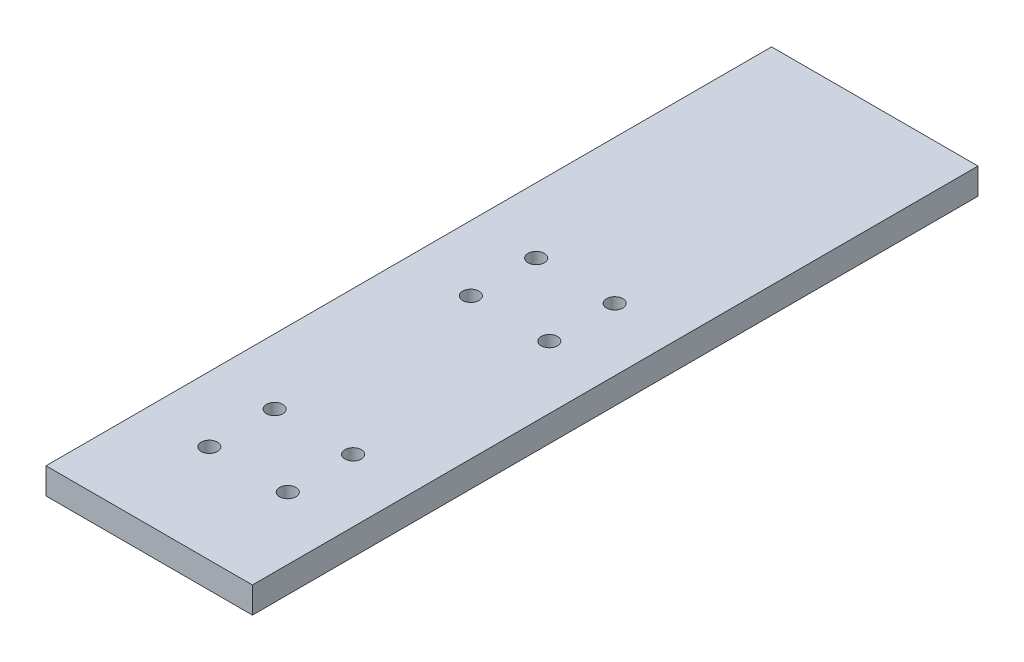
ISO-10303-21;
HEADER;
FILE_DESCRIPTION(('STEP AP214'),'2;1');
FILE_NAME('part.step','',(''),(''),'','','');
FILE_SCHEMA(('AUTOMOTIVE_DESIGN { 1 0 10303 214 1 1 1 1 }'));
ENDSEC;
DATA;
#1=APPLICATION_CONTEXT('core data for automotive mechanical design processes');
#2=APPLICATION_PROTOCOL_DEFINITION('international standard','automotive_design',2000,#1);
#3=PRODUCT_CONTEXT('',#1,'mechanical');
#4=PRODUCT('Part','Part','',(#3));
#5=PRODUCT_RELATED_PRODUCT_CATEGORY('part','',(#4));
#6=PRODUCT_DEFINITION_FORMATION('','',#4);
#7=PRODUCT_DEFINITION_CONTEXT('part definition',#1,'design');
#8=PRODUCT_DEFINITION('design','',#6,#7);
#9=PRODUCT_DEFINITION_SHAPE('','',#8);
#10=(LENGTH_UNIT() NAMED_UNIT(*) SI_UNIT(.MILLI.,.METRE.));
#11=(NAMED_UNIT(*) PLANE_ANGLE_UNIT() SI_UNIT($,.RADIAN.));
#12=(NAMED_UNIT(*) SI_UNIT($,.STERADIAN.) SOLID_ANGLE_UNIT());
#13=UNCERTAINTY_MEASURE_WITH_UNIT(LENGTH_MEASURE(1.E-05),#10,'distance_accuracy_value','');
#14=(GEOMETRIC_REPRESENTATION_CONTEXT(3) GLOBAL_UNCERTAINTY_ASSIGNED_CONTEXT((#13)) GLOBAL_UNIT_ASSIGNED_CONTEXT((#10,
#11,#12)) REPRESENTATION_CONTEXT('',''));
#15=CARTESIAN_POINT('',(0.,0.,0.));
#16=DIRECTION('',(0.,0.,1.));
#17=DIRECTION('',(1.,0.,0.));
#18=AXIS2_PLACEMENT_3D('',#15,#16,#17);
#19=CARTESIAN_POINT('',(198.0556,50.8,901.37465906));
#20=DIRECTION('',(-1.,0.,0.));
#21=DIRECTION('',(0.,0.,1.));
#22=AXIS2_PLACEMENT_3D('',#19,#20,#21);
#23=PLANE('',#22);
#24=DIRECTION('',(0.,0.,-1.));
#25=VECTOR('',#24,1.);
#26=CARTESIAN_POINT('',(198.0556,0.,901.37465906));
#27=LINE('',#26,#25);
#28=CARTESIAN_POINT('',(198.0556,0.,901.37465906));
#29=VERTEX_POINT('',#28);
#30=CARTESIAN_POINT('',(198.0556,0.,-508.00000001));
#31=VERTEX_POINT('',#30);
#32=EDGE_CURVE('E114',#29,#31,#27,.T.);
#33=ORIENTED_EDGE('',*,*,#32,.T.);
#34=DIRECTION('',(0.,-1.,0.));
#35=VECTOR('',#34,1.);
#36=CARTESIAN_POINT('',(198.0556,50.8,-508.00000001));
#37=LINE('',#36,#35);
#38=CARTESIAN_POINT('',(198.0556,50.8,-508.00000001));
#39=VERTEX_POINT('',#38);
#40=EDGE_CURVE('E11',#39,#31,#37,.T.);
#41=ORIENTED_EDGE('',*,*,#40,.F.);
#42=DIRECTION('',(0.,0.,-1.));
#43=VECTOR('',#42,1.);
#44=CARTESIAN_POINT('',(198.0556,50.8,901.37465906));
#45=LINE('',#44,#43);
#46=CARTESIAN_POINT('',(198.0556,50.8,901.37465906));
#47=VERTEX_POINT('',#46);
#48=EDGE_CURVE('E100',#47,#39,#45,.T.);
#49=ORIENTED_EDGE('',*,*,#48,.F.);
#50=DIRECTION('',(0.,-1.,0.));
#51=VECTOR('',#50,1.);
#52=CARTESIAN_POINT('',(198.0556,50.8,901.37465906));
#53=LINE('',#52,#51);
#54=EDGE_CURVE('E108',#47,#29,#53,.T.);
#55=ORIENTED_EDGE('',*,*,#54,.T.);
#56=EDGE_LOOP('',(#33,#41,#49,#55));
#57=FACE_BOUND('',#56,.T.);
#58=ADVANCED_FACE('F44',(#57),#23,.F.);
#59=CARTESIAN_POINT('',(198.0556,50.8,-508.00000001));
#60=DIRECTION('',(0.,0.,1.));
#61=DIRECTION('',(1.,0.,0.));
#62=AXIS2_PLACEMENT_3D('',#59,#60,#61);
#63=PLANE('',#62);
#64=DIRECTION('',(-1.,0.,0.));
#65=VECTOR('',#64,1.);
#66=CARTESIAN_POINT('',(198.0556,0.,-508.00000001));
#67=LINE('',#66,#65);
#68=CARTESIAN_POINT('',(-202.9084,0.,-508.00000001));
#69=VERTEX_POINT('',#68);
#70=EDGE_CURVE('E105',#31,#69,#67,.T.);
#71=ORIENTED_EDGE('',*,*,#70,.T.);
#72=DIRECTION('',(0.,-1.,0.));
#73=VECTOR('',#72,1.);
#74=CARTESIAN_POINT('',(-202.9084,50.8,-508.00000001));
#75=LINE('',#74,#73);
#76=CARTESIAN_POINT('',(-202.9084,50.8,-508.00000001));
#77=VERTEX_POINT('',#76);
#78=EDGE_CURVE('E53',#77,#69,#75,.T.);
#79=ORIENTED_EDGE('',*,*,#78,.F.);
#80=DIRECTION('',(-1.,0.,0.));
#81=VECTOR('',#80,1.);
#82=CARTESIAN_POINT('',(198.0556,50.8,-508.00000001));
#83=LINE('',#82,#81);
#84=EDGE_CURVE('E95',#39,#77,#83,.T.);
#85=ORIENTED_EDGE('',*,*,#84,.F.);
#86=ORIENTED_EDGE('',*,*,#40,.T.);
#87=EDGE_LOOP('',(#71,#79,#85,#86));
#88=FACE_BOUND('',#87,.T.);
#89=ADVANCED_FACE('F101',(#88),#63,.F.);
#90=CARTESIAN_POINT('',(-202.9084,50.8,901.37465906));
#91=DIRECTION('',(1.,0.,0.));
#92=DIRECTION('',(0.,0.,-1.));
#93=AXIS2_PLACEMENT_3D('',#90,#91,#92);
#94=PLANE('',#93);
#95=DIRECTION('',(0.,0.,1.));
#96=VECTOR('',#95,1.);
#97=CARTESIAN_POINT('',(-202.9084,0.,901.37465906));
#98=LINE('',#97,#96);
#99=CARTESIAN_POINT('',(-202.9084,0.,901.37465906));
#100=VERTEX_POINT('',#99);
#101=EDGE_CURVE('E76',#69,#100,#98,.T.);
#102=ORIENTED_EDGE('',*,*,#101,.T.);
#103=DIRECTION('',(0.,-1.,0.));
#104=VECTOR('',#103,1.);
#105=CARTESIAN_POINT('',(-202.9084,50.8,901.37465906));
#106=LINE('',#105,#104);
#107=CARTESIAN_POINT('',(-202.9084,50.8,901.37465906));
#108=VERTEX_POINT('',#107);
#109=EDGE_CURVE('E102',#108,#100,#106,.T.);
#110=ORIENTED_EDGE('',*,*,#109,.F.);
#111=DIRECTION('',(0.,0.,1.));
#112=VECTOR('',#111,1.);
#113=CARTESIAN_POINT('',(-202.9084,50.8,901.37465906));
#114=LINE('',#113,#112);
#115=EDGE_CURVE('E92',#77,#108,#114,.T.);
#116=ORIENTED_EDGE('',*,*,#115,.F.);
#117=ORIENTED_EDGE('',*,*,#78,.T.);
#118=EDGE_LOOP('',(#102,#110,#116,#117));
#119=FACE_BOUND('',#118,.T.);
#120=ADVANCED_FACE('F104',(#119),#94,.F.);
#121=CARTESIAN_POINT('',(198.0556,50.8,901.37465906));
#122=DIRECTION('',(0.,0.,-1.));
#123=DIRECTION('',(-1.,0.,0.));
#124=AXIS2_PLACEMENT_3D('',#121,#122,#123);
#125=PLANE('',#124);
#126=DIRECTION('',(1.,0.,0.));
#127=VECTOR('',#126,1.);
#128=CARTESIAN_POINT('',(198.0556,0.,901.37465906));
#129=LINE('',#128,#127);
#130=EDGE_CURVE('E81',#100,#29,#129,.T.);
#131=ORIENTED_EDGE('',*,*,#130,.T.);
#132=ORIENTED_EDGE('',*,*,#54,.F.);
#133=DIRECTION('',(1.,0.,0.));
#134=VECTOR('',#133,1.);
#135=CARTESIAN_POINT('',(198.0556,50.8,901.37465906));
#136=LINE('',#135,#134);
#137=EDGE_CURVE('E64',#108,#47,#136,.T.);
#138=ORIENTED_EDGE('',*,*,#137,.F.);
#139=ORIENTED_EDGE('',*,*,#109,.T.);
#140=EDGE_LOOP('',(#131,#132,#138,#139));
#141=FACE_BOUND('',#140,.T.);
#142=ADVANCED_FACE('F130',(#141),#125,.F.);
#143=CARTESIAN_POINT('',(0.,50.8,0.));
#144=DIRECTION('',(0.,1.,0.));
#145=DIRECTION('',(0.,0.,1.));
#146=AXIS2_PLACEMENT_3D('',#143,#144,#145);
#147=PLANE('',#146);
#148=CARTESIAN_POINT('',(-76.1999999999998,50.8,710.87465906));
#149=DIRECTION('',(0.,1.,0.));
#150=DIRECTION('',(0.,0.,1.));
#151=AXIS2_PLACEMENT_3D('',#148,#149,#150);
#152=CIRCLE('',#151,15.8749999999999);
#153=CARTESIAN_POINT('',(-76.1999999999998,50.8,726.74965906));
#154=VERTEX_POINT('',#153);
#155=EDGE_CURVE('E170',#154,#154,#152,.T.);
#156=ORIENTED_EDGE('',*,*,#155,.F.);
#157=EDGE_LOOP('',(#156));
#158=FACE_BOUND('',#157,.T.);
#159=CARTESIAN_POINT('',(-76.1999999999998,50.8,75.87465906));
#160=DIRECTION('',(0.,1.,0.));
#161=DIRECTION('',(0.,0.,1.));
#162=AXIS2_PLACEMENT_3D('',#159,#160,#161);
#163=CIRCLE('',#162,15.875);
#164=CARTESIAN_POINT('',(-76.1999999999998,50.8,91.7496590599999));
#165=VERTEX_POINT('',#164);
#166=EDGE_CURVE('E157',#165,#165,#163,.T.);
#167=ORIENTED_EDGE('',*,*,#166,.F.);
#168=EDGE_LOOP('',(#167));
#169=FACE_BOUND('',#168,.T.);
#170=CARTESIAN_POINT('',(76.2000000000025,50.8,75.87465906));
#171=DIRECTION('',(0.,1.,0.));
#172=DIRECTION('',(0.,0.,1.));
#173=AXIS2_PLACEMENT_3D('',#170,#171,#172);
#174=CIRCLE('',#173,15.875);
#175=CARTESIAN_POINT('',(76.2000000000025,50.8,91.7496590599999));
#176=VERTEX_POINT('',#175);
#177=EDGE_CURVE('E151',#176,#176,#174,.T.);
#178=ORIENTED_EDGE('',*,*,#177,.F.);
#179=EDGE_LOOP('',(#178));
#180=FACE_BOUND('',#179,.T.);
#181=CARTESIAN_POINT('',(76.2000000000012,50.8,583.87465906));
#182=DIRECTION('',(0.,1.,0.));
#183=DIRECTION('',(0.,0.,1.));
#184=AXIS2_PLACEMENT_3D('',#181,#182,#183);
#185=CIRCLE('',#184,15.875);
#186=CARTESIAN_POINT('',(76.2000000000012,50.8,599.74965906));
#187=VERTEX_POINT('',#186);
#188=EDGE_CURVE('E142',#187,#187,#185,.T.);
#189=ORIENTED_EDGE('',*,*,#188,.F.);
#190=EDGE_LOOP('',(#189));
#191=FACE_BOUND('',#190,.T.);
#192=CARTESIAN_POINT('',(-76.2000000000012,50.8,583.87465906));
#193=DIRECTION('',(0.,1.,0.));
#194=DIRECTION('',(0.,0.,1.));
#195=AXIS2_PLACEMENT_3D('',#192,#193,#194);
#196=CIRCLE('',#195,15.8749999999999);
#197=CARTESIAN_POINT('',(-76.2000000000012,50.8,599.74965906));
#198=VERTEX_POINT('',#197);
#199=EDGE_CURVE('E188',#198,#198,#196,.T.);
#200=ORIENTED_EDGE('',*,*,#199,.F.);
#201=EDGE_LOOP('',(#200));
#202=FACE_BOUND('',#201,.T.);
#203=CARTESIAN_POINT('',(-76.1999999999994,50.8,202.87465906));
#204=DIRECTION('',(0.,1.,0.));
#205=DIRECTION('',(0.,0.,1.));
#206=AXIS2_PLACEMENT_3D('',#203,#204,#205);
#207=CIRCLE('',#206,15.875);
#208=CARTESIAN_POINT('',(-76.1999999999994,50.8,218.74965906));
#209=VERTEX_POINT('',#208);
#210=EDGE_CURVE('E185',#209,#209,#207,.T.);
#211=ORIENTED_EDGE('',*,*,#210,.F.);
#212=EDGE_LOOP('',(#211));
#213=FACE_BOUND('',#212,.T.);
#214=CARTESIAN_POINT('',(76.2000000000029,50.8,202.87465906));
#215=DIRECTION('',(0.,1.,0.));
#216=DIRECTION('',(0.,0.,1.));
#217=AXIS2_PLACEMENT_3D('',#214,#215,#216);
#218=CIRCLE('',#217,15.8750000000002);
#219=CARTESIAN_POINT('',(76.2000000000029,50.8,218.74965906));
#220=VERTEX_POINT('',#219);
#221=EDGE_CURVE('E171',#220,#220,#218,.T.);
#222=ORIENTED_EDGE('',*,*,#221,.F.);
#223=EDGE_LOOP('',(#222));
#224=FACE_BOUND('',#223,.T.);
#225=CARTESIAN_POINT('',(76.2000000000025,50.8,710.87465906));
#226=DIRECTION('',(0.,1.,0.));
#227=DIRECTION('',(0.,0.,1.));
#228=AXIS2_PLACEMENT_3D('',#225,#226,#227);
#229=CIRCLE('',#228,15.8749999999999);
#230=CARTESIAN_POINT('',(76.2000000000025,50.8,726.74965906));
#231=VERTEX_POINT('',#230);
#232=EDGE_CURVE('E119',#231,#231,#229,.T.);
#233=ORIENTED_EDGE('',*,*,#232,.F.);
#234=EDGE_LOOP('',(#233));
#235=FACE_BOUND('',#234,.T.);
#236=ORIENTED_EDGE('',*,*,#48,.T.);
#237=ORIENTED_EDGE('',*,*,#84,.T.);
#238=ORIENTED_EDGE('',*,*,#115,.T.);
#239=ORIENTED_EDGE('',*,*,#137,.T.);
#240=EDGE_LOOP('',(#236,#237,#238,#239));
#241=FACE_BOUND('',#240,.T.);
#242=ADVANCED_FACE('F91',(#158,#169,#180,#191,#202,#213,#224,#235,#241),#147,.T.);
#243=CARTESIAN_POINT('',(0.,0.,0.));
#244=DIRECTION('',(0.,1.,0.));
#245=DIRECTION('',(0.,0.,1.));
#246=AXIS2_PLACEMENT_3D('',#243,#244,#245);
#247=PLANE('',#246);
#248=CARTESIAN_POINT('',(-76.1999999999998,0.,710.87465906));
#249=DIRECTION('',(0.,1.,0.));
#250=DIRECTION('',(0.,0.,1.));
#251=AXIS2_PLACEMENT_3D('',#248,#249,#250);
#252=CIRCLE('',#251,15.8749999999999);
#253=CARTESIAN_POINT('',(-76.1999999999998,0.,726.74965906));
#254=VERTEX_POINT('',#253);
#255=EDGE_CURVE('E137',#254,#254,#252,.T.);
#256=ORIENTED_EDGE('',*,*,#255,.T.);
#257=EDGE_LOOP('',(#256));
#258=FACE_BOUND('',#257,.T.);
#259=CARTESIAN_POINT('',(-76.1999999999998,0.,75.87465906));
#260=DIRECTION('',(0.,1.,0.));
#261=DIRECTION('',(0.,0.,1.));
#262=AXIS2_PLACEMENT_3D('',#259,#260,#261);
#263=CIRCLE('',#262,15.875);
#264=CARTESIAN_POINT('',(-76.1999999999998,0.,91.7496590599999));
#265=VERTEX_POINT('',#264);
#266=EDGE_CURVE('E162',#265,#265,#263,.T.);
#267=ORIENTED_EDGE('',*,*,#266,.T.);
#268=EDGE_LOOP('',(#267));
#269=FACE_BOUND('',#268,.T.);
#270=CARTESIAN_POINT('',(76.2000000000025,0.,75.87465906));
#271=DIRECTION('',(0.,1.,0.));
#272=DIRECTION('',(0.,0.,1.));
#273=AXIS2_PLACEMENT_3D('',#270,#271,#272);
#274=CIRCLE('',#273,15.875);
#275=CARTESIAN_POINT('',(76.2000000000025,0.,91.7496590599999));
#276=VERTEX_POINT('',#275);
#277=EDGE_CURVE('E154',#276,#276,#274,.T.);
#278=ORIENTED_EDGE('',*,*,#277,.T.);
#279=EDGE_LOOP('',(#278));
#280=FACE_BOUND('',#279,.T.);
#281=CARTESIAN_POINT('',(76.2000000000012,0.,583.87465906));
#282=DIRECTION('',(0.,1.,0.));
#283=DIRECTION('',(0.,0.,1.));
#284=AXIS2_PLACEMENT_3D('',#281,#282,#283);
#285=CIRCLE('',#284,15.875);
#286=CARTESIAN_POINT('',(76.2000000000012,0.,599.74965906));
#287=VERTEX_POINT('',#286);
#288=EDGE_CURVE('E148',#287,#287,#285,.T.);
#289=ORIENTED_EDGE('',*,*,#288,.T.);
#290=EDGE_LOOP('',(#289));
#291=FACE_BOUND('',#290,.T.);
#292=CARTESIAN_POINT('',(-76.2000000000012,0.,583.87465906));
#293=DIRECTION('',(0.,1.,0.));
#294=DIRECTION('',(0.,0.,1.));
#295=AXIS2_PLACEMENT_3D('',#292,#293,#294);
#296=CIRCLE('',#295,15.8749999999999);
#297=CARTESIAN_POINT('',(-76.2000000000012,0.,599.74965906));
#298=VERTEX_POINT('',#297);
#299=EDGE_CURVE('E150',#298,#298,#296,.T.);
#300=ORIENTED_EDGE('',*,*,#299,.T.);
#301=EDGE_LOOP('',(#300));
#302=FACE_BOUND('',#301,.T.);
#303=CARTESIAN_POINT('',(-76.1999999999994,0.,202.87465906));
#304=DIRECTION('',(0.,1.,0.));
#305=DIRECTION('',(0.,0.,1.));
#306=AXIS2_PLACEMENT_3D('',#303,#304,#305);
#307=CIRCLE('',#306,15.875);
#308=CARTESIAN_POINT('',(-76.1999999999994,0.,218.74965906));
#309=VERTEX_POINT('',#308);
#310=EDGE_CURVE('E187',#309,#309,#307,.T.);
#311=ORIENTED_EDGE('',*,*,#310,.T.);
#312=EDGE_LOOP('',(#311));
#313=FACE_BOUND('',#312,.T.);
#314=CARTESIAN_POINT('',(76.2000000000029,0.,202.87465906));
#315=DIRECTION('',(0.,1.,0.));
#316=DIRECTION('',(0.,0.,1.));
#317=AXIS2_PLACEMENT_3D('',#314,#315,#316);
#318=CIRCLE('',#317,15.8750000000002);
#319=CARTESIAN_POINT('',(76.2000000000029,0.,218.74965906));
#320=VERTEX_POINT('',#319);
#321=EDGE_CURVE('E177',#320,#320,#318,.T.);
#322=ORIENTED_EDGE('',*,*,#321,.T.);
#323=EDGE_LOOP('',(#322));
#324=FACE_BOUND('',#323,.T.);
#325=CARTESIAN_POINT('',(76.2000000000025,0.,710.87465906));
#326=DIRECTION('',(0.,1.,0.));
#327=DIRECTION('',(0.,0.,1.));
#328=AXIS2_PLACEMENT_3D('',#325,#326,#327);
#329=CIRCLE('',#328,15.8749999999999);
#330=CARTESIAN_POINT('',(76.2000000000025,0.,726.74965906));
#331=VERTEX_POINT('',#330);
#332=EDGE_CURVE('E131',#331,#331,#329,.T.);
#333=ORIENTED_EDGE('',*,*,#332,.T.);
#334=EDGE_LOOP('',(#333));
#335=FACE_BOUND('',#334,.T.);
#336=ORIENTED_EDGE('',*,*,#32,.F.);
#337=ORIENTED_EDGE('',*,*,#130,.F.);
#338=ORIENTED_EDGE('',*,*,#101,.F.);
#339=ORIENTED_EDGE('',*,*,#70,.F.);
#340=EDGE_LOOP('',(#336,#337,#338,#339));
#341=FACE_BOUND('',#340,.T.);
#342=ADVANCED_FACE('F128',(#258,#269,#280,#291,#302,#313,#324,#335,#341),#247,.F.);
#343=CARTESIAN_POINT('',(76.2000000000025,50.8,710.87465906));
#344=DIRECTION('',(0.,-1.,0.));
#345=DIRECTION('',(0.,0.,-1.));
#346=AXIS2_PLACEMENT_3D('',#343,#344,#345);
#347=CYLINDRICAL_SURFACE('',#346,15.8749999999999);
#348=ORIENTED_EDGE('',*,*,#232,.T.);
#349=EDGE_LOOP('',(#348));
#350=FACE_BOUND('',#349,.T.);
#351=ORIENTED_EDGE('',*,*,#332,.F.);
#352=EDGE_LOOP('',(#351));
#353=FACE_BOUND('',#352,.T.);
#354=ADVANCED_FACE('F226',(#350,#353),#347,.F.);
#355=CARTESIAN_POINT('',(76.2000000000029,50.8,202.87465906));
#356=DIRECTION('',(0.,-1.,0.));
#357=DIRECTION('',(0.,0.,-1.));
#358=AXIS2_PLACEMENT_3D('',#355,#356,#357);
#359=CYLINDRICAL_SURFACE('',#358,15.8750000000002);
#360=ORIENTED_EDGE('',*,*,#221,.T.);
#361=EDGE_LOOP('',(#360));
#362=FACE_BOUND('',#361,.T.);
#363=ORIENTED_EDGE('',*,*,#321,.F.);
#364=EDGE_LOOP('',(#363));
#365=FACE_BOUND('',#364,.T.);
#366=ADVANCED_FACE('F213',(#362,#365),#359,.F.);
#367=CARTESIAN_POINT('',(-76.1999999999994,50.8,202.87465906));
#368=DIRECTION('',(0.,-1.,0.));
#369=DIRECTION('',(0.,0.,-1.));
#370=AXIS2_PLACEMENT_3D('',#367,#368,#369);
#371=CYLINDRICAL_SURFACE('',#370,15.875);
#372=ORIENTED_EDGE('',*,*,#210,.T.);
#373=EDGE_LOOP('',(#372));
#374=FACE_BOUND('',#373,.T.);
#375=ORIENTED_EDGE('',*,*,#310,.F.);
#376=EDGE_LOOP('',(#375));
#377=FACE_BOUND('',#376,.T.);
#378=ADVANCED_FACE('F201',(#374,#377),#371,.F.);
#379=CARTESIAN_POINT('',(-76.2000000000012,50.8,583.87465906));
#380=DIRECTION('',(0.,-1.,0.));
#381=DIRECTION('',(0.,0.,-1.));
#382=AXIS2_PLACEMENT_3D('',#379,#380,#381);
#383=CYLINDRICAL_SURFACE('',#382,15.8749999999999);
#384=ORIENTED_EDGE('',*,*,#199,.T.);
#385=EDGE_LOOP('',(#384));
#386=FACE_BOUND('',#385,.T.);
#387=ORIENTED_EDGE('',*,*,#299,.F.);
#388=EDGE_LOOP('',(#387));
#389=FACE_BOUND('',#388,.T.);
#390=ADVANCED_FACE('F199',(#386,#389),#383,.F.);
#391=CARTESIAN_POINT('',(76.2000000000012,50.8,583.87465906));
#392=DIRECTION('',(0.,-1.,0.));
#393=DIRECTION('',(0.,0.,-1.));
#394=AXIS2_PLACEMENT_3D('',#391,#392,#393);
#395=CYLINDRICAL_SURFACE('',#394,15.875);
#396=ORIENTED_EDGE('',*,*,#188,.T.);
#397=EDGE_LOOP('',(#396));
#398=FACE_BOUND('',#397,.T.);
#399=ORIENTED_EDGE('',*,*,#288,.F.);
#400=EDGE_LOOP('',(#399));
#401=FACE_BOUND('',#400,.T.);
#402=ADVANCED_FACE('F205',(#398,#401),#395,.F.);
#403=CARTESIAN_POINT('',(76.2000000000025,50.8,75.87465906));
#404=DIRECTION('',(0.,-1.,0.));
#405=DIRECTION('',(0.,0.,-1.));
#406=AXIS2_PLACEMENT_3D('',#403,#404,#405);
#407=CYLINDRICAL_SURFACE('',#406,15.875);
#408=ORIENTED_EDGE('',*,*,#177,.T.);
#409=EDGE_LOOP('',(#408));
#410=FACE_BOUND('',#409,.T.);
#411=ORIENTED_EDGE('',*,*,#277,.F.);
#412=EDGE_LOOP('',(#411));
#413=FACE_BOUND('',#412,.T.);
#414=ADVANCED_FACE('F209',(#410,#413),#407,.F.);
#415=CARTESIAN_POINT('',(-76.1999999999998,50.8,75.87465906));
#416=DIRECTION('',(0.,-1.,0.));
#417=DIRECTION('',(0.,0.,-1.));
#418=AXIS2_PLACEMENT_3D('',#415,#416,#417);
#419=CYLINDRICAL_SURFACE('',#418,15.875);
#420=ORIENTED_EDGE('',*,*,#166,.T.);
#421=EDGE_LOOP('',(#420));
#422=FACE_BOUND('',#421,.T.);
#423=ORIENTED_EDGE('',*,*,#266,.F.);
#424=EDGE_LOOP('',(#423));
#425=FACE_BOUND('',#424,.T.);
#426=ADVANCED_FACE('F239',(#422,#425),#419,.F.);
#427=CARTESIAN_POINT('',(-76.1999999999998,50.8,710.87465906));
#428=DIRECTION('',(0.,-1.,0.));
#429=DIRECTION('',(0.,0.,-1.));
#430=AXIS2_PLACEMENT_3D('',#427,#428,#429);
#431=CYLINDRICAL_SURFACE('',#430,15.8749999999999);
#432=ORIENTED_EDGE('',*,*,#155,.T.);
#433=EDGE_LOOP('',(#432));
#434=FACE_BOUND('',#433,.T.);
#435=ORIENTED_EDGE('',*,*,#255,.F.);
#436=EDGE_LOOP('',(#435));
#437=FACE_BOUND('',#436,.T.);
#438=ADVANCED_FACE('F245',(#434,#437),#431,.F.);
#439=CLOSED_SHELL('',(#58,#89,#120,#142,#242,#342,#354,#366,#378,#390,#402,#414,#426,#438));
#440=MANIFOLD_SOLID_BREP('B2',#439);
#441=ADVANCED_BREP_SHAPE_REPRESENTATION('',(#18,#440),#14);
#442=SHAPE_DEFINITION_REPRESENTATION(#9,#441);
ENDSEC;
END-ISO-10303-21;
